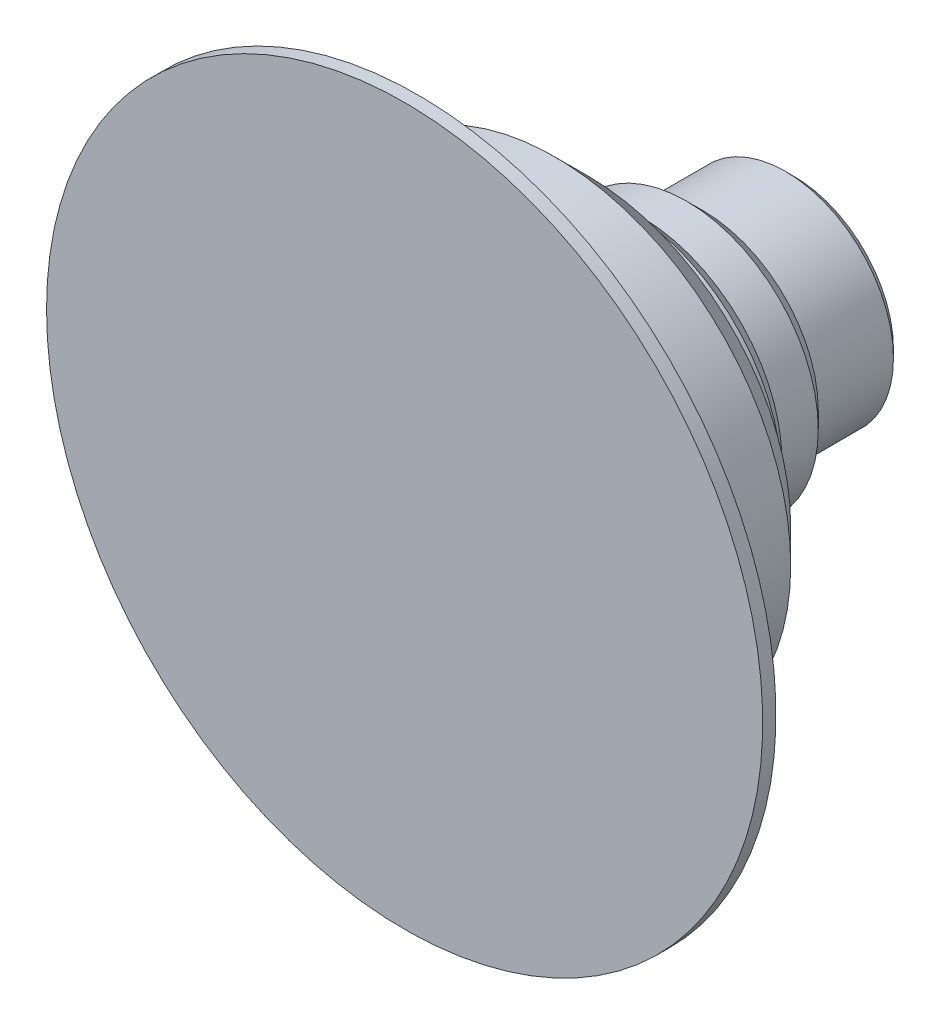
from build123d import *

# Parameters (mm, degrees)
CHAMFER1_SIZE      = 2.54
CHAMFER2_SIZE      = 1.27
CHAMFER3_SIZE      = 0.635
CUT_EXTRUDE1_DEPTH = 0.254


with BuildPart() as part:
    # Sketch1 → Revolve1 (revolve)
    with BuildSketch(Plane(origin=(0, 0, 0), x_dir=(1, 0, 0), z_dir=(0, 1, 0)), mode=Mode.PRIVATE) as revolve1_sk:
        Polygon((0, 0), (27.0891, 0), (27.0891, 1), (19.4691, 1), (19.4691, 3.173357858), (17.8435, 3.173357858), (17.8435, 13.9032), (11.9761, 13.9032), (11.9761, 17.8402), (9.9695, 17.8402), (9.9695, 22.59), (8.1661, 22.59), (8.1661, 29.448), (3.429, 29.448), (3.429, 28.94), (0, 28.94), (0, 13.9032), align=None)
    revolve(revolve1_sk.sketch.rotate(Axis((0, 0, -13.9032), (0, 0, 1)), 180), axis=Axis((0, 0, -13.9032), (0, 0, 1)))

    # Chamfer1
    chamfer1_edges = [part.edges().sort_by_distance(p)[0] for p in [
        (17.8435, 0, -13.9032),
    ]]
    chamfer(chamfer1_edges, length=CHAMFER1_SIZE)

    # Chamfer2
    chamfer2_edges = [part.edges().sort_by_distance(p)[0] for p in [
        (9.9695, 0, -22.59),
        (11.9761, 0, -17.8402),
    ]]
    chamfer(chamfer2_edges, length=CHAMFER2_SIZE)

    # Chamfer3
    chamfer3_edges = [part.edges().sort_by_distance(p)[0] for p in [
        (8.1661, 0, -29.448),
    ]]
    chamfer(chamfer3_edges, length=CHAMFER3_SIZE)

    # Sketch2 → Cut-Extrude1 (cut)
    with BuildSketch(Plane(origin=(0, 0, -1), x_dir=(-1, 0, 0), z_dir=(0, 0, -1))):
        with BuildLine():
            Line((-6.428783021, -21.571208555), (-6.742885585, -21.571208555))
            add(Edge.make_bspline(
                [(-6.742885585, -21.571208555), (-6.734376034, -21.535976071), (-6.717740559, -21.467099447), (-6.683042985, -21.368692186), (-6.64524373, -21.275568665), (-6.599854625, -21.189472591), (-6.550345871, -21.108673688), (-6.49362315, -21.035004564), (-6.432303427, -20.966591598), (-6.364478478, -20.905878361), (-6.293349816, -20.850900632), (-6.217915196, -20.804025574), (-6.139692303, -20.763701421), (-6.05813917, -20.73048119), (-5.973012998, -20.705455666), (-5.885083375, -20.68729886), (-5.794119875, -20.675507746), (-5.732372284, -20.674356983), (-5.701018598, -20.673772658)],
                knots=[0, 0, 0, 0, 1.162005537, 2.271625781, 3.343758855, 4.383309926, 5.390229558, 6.379919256, 7.361854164, 8.333198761, 9.295911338, 10.242430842, 11.177959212, 12.116337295, 13.062827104, 14.020064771, 14.994644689, 16, 16, 16, 16], degree=3))
            add(Edge.make_bspline(
                [(-5.701018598, -20.673772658), (-5.655335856, -20.675151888), (-5.564966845, -20.677880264), (-5.432203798, -20.7027947), (-5.304176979, -20.742219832), (-5.182287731, -20.79669356), (-5.069069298, -20.863880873), (-4.968333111, -20.94384561), (-4.881444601, -21.035044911), (-4.808550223, -21.135777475), (-4.751475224, -21.243432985), (-4.70938885, -21.354233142), (-4.683767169, -21.467915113), (-4.680446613, -21.544672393), (-4.678783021, -21.583127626)],
                knots=[0, 0, 0, 0, 1.083050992, 2.142477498, 3.193116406, 4.255571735, 5.30263384, 6.308962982, 7.297363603, 8.282367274, 9.249857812, 10.179914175, 11.08814088, 12, 12, 12, 12], degree=3))
            add(Edge.make_bspline(
                [(-4.678783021, -21.583127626), (-4.679946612, -21.620134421), (-4.682223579, -21.692550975), (-4.701557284, -21.798272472), (-4.734093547, -21.897914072), (-4.77916331, -21.991895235), (-4.83750486, -22.079620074), (-4.908177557, -22.161285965), (-4.991680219, -22.237255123), (-5.054959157, -22.280774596), (-5.087537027, -22.303179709)],
                knots=[0, 0, 0, 0, 1.024540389, 2.004866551, 2.965041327, 3.920577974, 4.882998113, 5.874504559, 6.905732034, 8, 8, 8, 8], degree=3))
            add(Edge.make_bspline(
                [(-5.087537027, -22.303179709), (-5.050305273, -22.321157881), (-4.976538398, -22.356777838), (-4.875987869, -22.426633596), (-4.784709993, -22.507289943), (-4.733806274, -22.570232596), (-4.708230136, -22.601857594)],
                knots=[0, 0, 0, 0, 1.015518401, 2.012035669, 3.001164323, 4, 4, 4, 4], degree=3))
            add(Edge.make_bspline(
                [(-4.708230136, -22.601857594), (-4.691388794, -22.624915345), (-4.657981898, -22.670653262), (-4.616746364, -22.744189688), (-4.57933725, -22.818541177), (-4.55018703, -22.895700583), (-4.527613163, -22.974773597), (-4.511477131, -23.055895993), (-4.50145299, -23.139134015), (-4.500017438, -23.195446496), (-4.499295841, -23.223752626)],
                knots=[0, 0, 0, 0, 1.025084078, 2.033381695, 3.024893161, 4.013698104, 4.991890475, 5.976764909, 6.982997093, 8, 8, 8, 8], degree=3))
            add(Edge.make_bspline(
                [(-4.499295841, -23.223752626), (-4.501090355, -23.272762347), (-4.504670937, -23.370551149), (-4.536675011, -23.515025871), (-4.586288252, -23.656251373), (-4.656745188, -23.791326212), (-4.742612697, -23.917706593), (-4.844770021, -24.030782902), (-4.962056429, -24.127981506), (-5.092862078, -24.209191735), (-5.234579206, -24.274109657), (-5.386154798, -24.3191671), (-5.545404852, -24.348513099), (-5.65461215, -24.351659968), (-5.710133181, -24.353259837)],
                knots=[0, 0, 0, 0, 0.955779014, 1.907060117, 2.875433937, 3.871313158, 4.872415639, 5.851225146, 6.836215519, 7.83643374, 8.849228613, 9.86973379, 10.916971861, 12, 12, 12, 12], degree=3))
            add(Edge.make_bspline(
                [(-5.710133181, -24.353259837), (-5.747552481, -24.352391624), (-5.821181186, -24.35068327), (-5.929424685, -24.339004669), (-6.032746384, -24.317674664), (-6.131285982, -24.288971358), (-6.225131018, -24.252579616), (-6.313995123, -24.207260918), (-6.398425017, -24.153949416), (-6.477623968, -24.092015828), (-6.551582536, -24.022734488), (-6.61833526, -23.944875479), (-6.678995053, -23.859878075), (-6.731937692, -23.766755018), (-6.779574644, -23.666709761), (-6.818755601, -23.558461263), (-6.85324117, -23.442977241), (-6.869274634, -23.362499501), (-6.877500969, -23.321208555)],
                knots=[0, 0, 0, 0, 1.048658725, 2.063410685, 3.046034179, 4.001477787, 4.936774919, 5.862367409, 6.792675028, 7.730719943, 8.675894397, 9.627829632, 10.600096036, 11.597688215, 12.626045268, 13.701542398, 14.82072376, 16, 16, 16, 16], degree=3))
            Line((-6.877500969, -23.321208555), (-6.563398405, -23.321208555))
            add(Edge.make_bspline(
                [(-6.563398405, -23.321208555), (-6.555215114, -23.348157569), (-6.539297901, -23.40057574), (-6.512203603, -23.476016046), (-6.481335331, -23.545174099), (-6.448220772, -23.608557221), (-6.413442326, -23.666789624), (-6.374527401, -23.718331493), (-6.334358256, -23.765446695), (-6.304078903, -23.791991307), (-6.289259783, -23.804982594)],
                knots=[0, 0, 0, 0, 1.198163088, 2.33053128, 3.407730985, 4.417276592, 5.372219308, 6.28897303, 7.162600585, 8, 8, 8, 8], degree=3))
            add(Edge.make_bspline(
                [(-6.289259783, -23.804982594), (-6.269663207, -23.820090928), (-6.230530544, -23.85026096), (-6.166762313, -23.888762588), (-6.099697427, -23.922123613), (-6.027882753, -23.947607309), (-5.952867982, -23.96918497), (-5.873440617, -23.983305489), (-5.7903014, -23.99299366), (-5.733533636, -23.993848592), (-5.704524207, -23.994285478)],
                knots=[0, 0, 0, 0, 0.946170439, 1.889420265, 2.845303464, 3.807233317, 4.801018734, 5.828864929, 6.890507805, 8, 8, 8, 8], degree=3))
            add(Edge.make_bspline(
                [(-5.704524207, -23.994285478), (-5.671770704, -23.993669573), (-5.607724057, -23.992465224), (-5.514269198, -23.981389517), (-5.42536175, -23.965259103), (-5.341988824, -23.940346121), (-5.263058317, -23.909565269), (-5.189676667, -23.870916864), (-5.120880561, -23.825572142), (-5.057551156, -23.774032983), (-5.000605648, -23.717611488), (-4.950466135, -23.658598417), (-4.907841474, -23.597242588), (-4.873457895, -23.533204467), (-4.846307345, -23.466749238), (-4.827824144, -23.397690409), (-4.814972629, -23.326593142), (-4.813926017, -23.278264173), (-4.813398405, -23.253900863)],
                knots=[0, 0, 0, 0, 1.217147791, 2.380027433, 3.494444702, 4.572153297, 5.609568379, 6.639424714, 7.649109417, 8.668170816, 9.669597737, 10.625200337, 11.543417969, 12.441394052, 13.322311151, 14.205496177, 15.095365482, 16, 16, 16, 16], degree=3))
            add(Edge.make_bspline(
                [(-4.813398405, -23.253900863), (-4.814928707, -23.221289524), (-4.817981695, -23.156229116), (-4.841290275, -23.060511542), (-4.879629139, -22.968288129), (-4.93330165, -22.881132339), (-4.998637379, -22.800356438), (-5.075002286, -22.728284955), (-5.163030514, -22.668814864), (-5.244050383, -22.627726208), (-5.31581554, -22.599689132), (-5.377230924, -22.581014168), (-5.445987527, -22.565200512), (-5.521253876, -22.550488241), (-5.603597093, -22.537966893), (-5.692927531, -22.527525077), (-5.789263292, -22.519170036), (-5.855954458, -22.515438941), (-5.890321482, -22.513516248)],
                knots=[0, 0, 0, 0, 1.07054697, 2.135767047, 3.216561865, 4.33974944, 5.486079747, 6.621378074, 7.775625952, 8.963672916, 9.598146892, 10.304877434, 11.070270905, 11.915000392, 12.823868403, 13.805723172, 14.86925407, 16, 16, 16, 16], degree=3))
            Line((-5.890321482, -22.513516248), (-5.890321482, -22.154541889))
            add(Edge.make_bspline(
                [(-5.890321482, -22.154541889), (-5.847020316, -22.153807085), (-5.76220397, -22.152367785), (-5.638309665, -22.134959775), (-5.519836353, -22.110879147), (-5.409409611, -22.073993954), (-5.308760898, -22.031153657), (-5.221441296, -21.981301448), (-5.148674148, -21.925886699), (-5.090813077, -21.864054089), (-5.047283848, -21.797739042), (-5.015457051, -21.728622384), (-4.996656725, -21.656098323), (-4.994147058, -21.606603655), (-4.992885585, -21.581725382)],
                knots=[0, 0, 0, 0, 1.321986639, 2.589447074, 3.816329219, 5.01088745, 6.139805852, 7.153945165, 8.075214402, 8.924034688, 9.728124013, 10.488707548, 11.240355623, 12, 12, 12, 12], degree=3))
            add(Edge.make_bspline(
                [(-4.992885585, -21.581725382), (-4.993299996, -21.563447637), (-4.994124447, -21.52708493), (-5.004521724, -21.473959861), (-5.020145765, -21.422458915), (-5.041625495, -21.372801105), (-5.070375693, -21.325330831), (-5.10478168, -21.279643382), (-5.14574978, -21.235999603), (-5.192695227, -21.195319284), (-5.243107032, -21.156550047), (-5.298356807, -21.12363641), (-5.356778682, -21.095491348), (-5.418437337, -21.072281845), (-5.483532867, -21.054822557), (-5.551759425, -21.042286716), (-5.623247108, -21.034449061), (-5.67201884, -21.033320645), (-5.696811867, -21.032747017)],
                knots=[0, 0, 0, 0, 0.884392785, 1.759457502, 2.611959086, 3.489218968, 4.37281399, 5.2945488, 6.255912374, 7.266815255, 8.301784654, 9.332968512, 10.37626691, 11.440494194, 12.520033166, 13.637162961, 14.798855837, 16, 16, 16, 16], degree=3))
            add(Edge.make_bspline(
                [(-5.696811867, -21.032747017), (-5.736663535, -21.034138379), (-5.814503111, -21.036856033), (-5.926718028, -21.060659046), (-6.031037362, -21.098637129), (-6.110776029, -21.143970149), (-6.169658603, -21.188720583), (-6.211735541, -21.227802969), (-6.253056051, -21.271235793), (-6.290901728, -21.321694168), (-6.329175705, -21.375760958), (-6.364020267, -21.43618464), (-6.397879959, -21.501389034), (-6.418282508, -21.547484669), (-6.428783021, -21.571208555)],
                knots=[0, 0, 0, 0, 1.472543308, 2.876219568, 4.221790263, 5.565193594, 6.249813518, 6.953379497, 7.687249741, 8.463570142, 9.283606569, 10.136032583, 11.040678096, 12, 12, 12, 12], degree=3))
        make_face()
        with BuildLine():
            Line((-1.986475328, -20.763516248), (-1.986475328, -21.122490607))
            Line((-1.986475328, -21.122490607), (-3.176980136, -21.122490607))
            Line((-3.176980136, -21.122490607), (-3.365581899, -22.043063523))
            add(Edge.make_bspline(
                [(-3.365581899, -22.043063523), (-3.328526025, -22.032833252), (-3.256736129, -22.013013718), (-3.150776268, -21.991007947), (-3.050184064, -21.977742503), (-2.984908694, -21.975931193), (-2.953322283, -21.975054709)],
                knots=[0, 0, 0, 0, 1.100273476, 2.13160584, 3.095893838, 4, 4, 4, 4], degree=3))
            add(Edge.make_bspline(
                [(-2.953322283, -21.975054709), (-2.914238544, -21.975900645), (-2.837390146, -21.977563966), (-2.724951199, -21.993535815), (-2.617618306, -22.01867573), (-2.515615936, -22.053796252), (-2.418755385, -22.098705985), (-2.327927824, -22.154805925), (-2.241769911, -22.220339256), (-2.161827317, -22.295684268), (-2.089303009, -22.378605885), (-2.025537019, -22.467763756), (-1.971374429, -22.562291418), (-1.927813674, -22.663092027), (-1.89302934, -22.76905118), (-1.869877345, -22.881283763), (-1.854460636, -22.998731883), (-1.85273825, -23.079036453), (-1.851859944, -23.1199866)],
                knots=[0, 0, 0, 0, 1.052922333, 2.070308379, 3.05430497, 4.020497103, 4.973039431, 5.925935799, 6.892292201, 7.88610001, 8.88166317, 9.857072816, 10.836096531, 11.812156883, 12.81219415, 13.836441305, 14.89672472, 16, 16, 16, 16], degree=3))
            add(Edge.make_bspline(
                [(-1.851859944, -23.1199866), (-1.852525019, -23.148508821), (-1.853846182, -23.205167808), (-1.860564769, -23.289312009), (-1.873500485, -23.371674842), (-1.890868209, -23.452267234), (-1.913410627, -23.530936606), (-1.940699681, -23.607908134), (-1.974095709, -23.682702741), (-2.010727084, -23.756028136), (-2.051973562, -23.826226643), (-2.097752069, -23.891875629), (-2.146117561, -23.953959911), (-2.198158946, -24.011813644), (-2.254359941, -24.065056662), (-2.314039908, -24.114004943), (-2.376722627, -24.159486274), (-2.443377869, -24.199654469), (-2.512520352, -24.236617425), (-2.58514857, -24.266940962), (-2.65960927, -24.29405149), (-2.736974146, -24.315661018), (-2.817067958, -24.332593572), (-2.900022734, -24.344094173), (-2.985403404, -24.352470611), (-3.043278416, -24.352994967), (-3.072512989, -24.353259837)],
                knots=[0, 0, 0, 0, 1.056347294, 2.098418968, 3.122841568, 4.141288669, 5.149314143, 6.15115421, 7.162517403, 8.180376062, 9.185164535, 10.17417709, 11.141909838, 12.097768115, 13.052685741, 14.0056014, 14.954263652, 15.917497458, 16.885230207, 17.854509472, 18.828990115, 19.81800267, 20.826176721, 21.857883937, 22.917946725, 24, 24, 24, 24], degree=3))
            add(Edge.make_bspline(
                [(-3.072512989, -24.353259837), (-3.107387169, -24.352568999), (-3.175998, -24.351209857), (-3.276518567, -24.336991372), (-3.373233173, -24.316627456), (-3.465363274, -24.285991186), (-3.553734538, -24.247603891), (-3.637157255, -24.19908772), (-3.717763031, -24.144108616), (-3.792275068, -24.079228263), (-3.861431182, -24.008312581), (-3.923337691, -23.93135494), (-3.978471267, -23.849625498), (-4.025949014, -23.762727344), (-4.066447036, -23.670888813), (-4.098262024, -23.573765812), (-4.123940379, -23.471865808), (-4.134803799, -23.401712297), (-4.140321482, -23.36608035)],
                knots=[0, 0, 0, 0, 1.0467383, 2.05933395, 3.04377827, 4.011590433, 4.970194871, 5.932262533, 6.905835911, 7.896367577, 8.894135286, 9.877477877, 10.858688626, 11.851381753, 12.8477658, 13.868841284, 14.917554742, 16, 16, 16, 16], degree=3))
            Line((-4.140321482, -23.36608035), (-3.826218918, -23.36608035))
            add(Edge.make_bspline(
                [(-3.826218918, -23.36608035), (-3.818490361, -23.399456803), (-3.803635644, -23.463608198), (-3.771029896, -23.553739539), (-3.73116402, -23.634058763), (-3.683759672, -23.705628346), (-3.627209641, -23.768037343), (-3.562680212, -23.823654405), (-3.490332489, -23.873829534), (-3.409939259, -23.915652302), (-3.32512618, -23.951321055), (-3.23635897, -23.97507275), (-3.146054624, -23.991773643), (-3.084976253, -23.993445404), (-3.054283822, -23.994285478)],
                knots=[0, 0, 0, 0, 1.136247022, 2.183929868, 3.172523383, 4.106158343, 5.02341133, 5.958108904, 6.928429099, 7.938127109, 8.96079061, 9.975095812, 10.982467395, 12, 12, 12, 12], degree=3))
            add(Edge.make_bspline(
                [(-3.054283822, -23.994285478), (-3.024325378, -23.993464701), (-2.965336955, -23.991848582), (-2.878525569, -23.97940957), (-2.794712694, -23.960251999), (-2.714725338, -23.931582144), (-2.637163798, -23.896737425), (-2.563990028, -23.85202235), (-2.493087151, -23.800562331), (-2.426659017, -23.741605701), (-2.365819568, -23.676636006), (-2.312063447, -23.607158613), (-2.267286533, -23.533041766), (-2.229552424, -23.455568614), (-2.200899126, -23.373890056), (-2.180458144, -23.288388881), (-2.168455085, -23.198853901), (-2.166803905, -23.137784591), (-2.165962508, -23.106665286)],
                knots=[0, 0, 0, 0, 1.027316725, 2.022795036, 3.002884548, 3.971462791, 4.93288096, 5.914575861, 6.907176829, 7.935150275, 8.956128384, 9.956726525, 10.942570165, 11.921478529, 12.907843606, 13.90538589, 14.932640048, 16, 16, 16, 16], degree=3))
            add(Edge.make_bspline(
                [(-2.165962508, -23.106665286), (-2.166620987, -23.078589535), (-2.167909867, -23.023635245), (-2.178440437, -22.943236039), (-2.19675741, -22.867162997), (-2.22218129, -22.795048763), (-2.254460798, -22.72682532), (-2.29390711, -22.66242226), (-2.341260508, -22.602688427), (-2.395352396, -22.547595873), (-2.454610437, -22.496750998), (-2.52005418, -22.453406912), (-2.590314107, -22.416942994), (-2.664543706, -22.385474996), (-2.744508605, -22.362874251), (-2.828625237, -22.345906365), (-2.917801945, -22.336091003), (-2.978772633, -22.334729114), (-3.010113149, -22.334029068)],
                knots=[0, 0, 0, 0, 1.045622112, 2.046656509, 3.013763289, 3.955457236, 4.890082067, 5.820317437, 6.762574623, 7.722996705, 8.69280354, 9.665887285, 10.63943826, 11.638615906, 12.663482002, 13.728887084, 14.832589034, 16, 16, 16, 16], degree=3))
            add(Edge.make_bspline(
                [(-3.010113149, -22.334029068), (-3.037242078, -22.334609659), (-3.093256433, -22.335808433), (-3.17917926, -22.34463493), (-3.269470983, -22.358874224), (-3.363785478, -22.378460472), (-3.462405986, -22.404091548), (-3.565124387, -22.434806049), (-3.672156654, -22.471528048), (-3.744274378, -22.499260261), (-3.781347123, -22.513516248)],
                knots=[0, 0, 0, 0, 0.817624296, 1.688186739, 2.600797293, 3.572016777, 4.590301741, 5.671205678, 6.80286297, 8, 8, 8, 8], degree=3))
            Line((-3.781347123, -22.513516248), (-3.422372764, -20.763516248))
            Line((-3.422372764, -20.763516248), (-1.986475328, -20.763516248))
        make_face()
        with BuildLine():
            Line((-1.26852661, -21.70582394), (-0.954424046, -21.70582394))
            Line((-0.954424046, -21.70582394), (-0.954424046, -22.150335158))
            add(Edge.make_bspline(
                [(-0.954424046, -22.150335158), (-0.926140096, -22.111447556), (-0.871945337, -22.036935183), (-0.783079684, -21.938744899), (-0.694303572, -21.855416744), (-0.63037019, -21.811673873), (-0.599656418, -21.790659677)],
                knots=[0, 0, 0, 0, 1.134379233, 2.173579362, 3.122582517, 4, 4, 4, 4], degree=3))
            add(Edge.make_bspline(
                [(-0.599656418, -21.790659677), (-0.557791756, -21.770654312), (-0.474793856, -21.730993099), (-0.343374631, -21.69075954), (-0.208899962, -21.666034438), (-0.118091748, -21.662653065), (-0.072412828, -21.660952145)],
                knots=[0, 0, 0, 0, 1.014936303, 2.012140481, 3.000054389, 4, 4, 4, 4], degree=3))
            add(Edge.make_bspline(
                [(-0.072412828, -21.660952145), (-0.041519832, -21.661997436), (0.019615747, -21.66406601), (0.110199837, -21.677526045), (0.198058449, -21.700792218), (0.282672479, -21.733199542), (0.362393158, -21.772446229), (0.435482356, -21.818495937), (0.501106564, -21.870193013), (0.559232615, -21.929871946), (0.61150164, -21.999208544), (0.659580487, -22.080072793), (0.704005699, -22.174280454), (0.728627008, -22.242646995), (0.741589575, -22.278640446)],
                knots=[0, 0, 0, 0, 1.009824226, 1.998387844, 2.986035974, 3.974953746, 4.955485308, 5.885931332, 6.793869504, 7.679848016, 8.601185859, 9.625726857, 10.749998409, 12, 12, 12, 12], degree=3))
            add(Edge.make_bspline(
                [(0.741589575, -22.278640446), (0.755300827, -22.253916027), (0.782282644, -22.205261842), (0.827588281, -22.13640358), (0.875056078, -22.071996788), (0.925090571, -22.011990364), (0.977515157, -21.956680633), (1.032576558, -21.905884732), (1.089961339, -21.859384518), (1.169753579, -21.805061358), (1.273566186, -21.747360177), (1.404454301, -21.697331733), (1.540604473, -21.666415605), (1.633022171, -21.662785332), (1.679690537, -21.660952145)],
                knots=[0, 0, 0, 0, 0.86119277, 1.694706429, 2.50939023, 3.298075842, 4.073795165, 4.829715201, 5.57930267, 6.321991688, 7.768977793, 9.186738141, 10.579381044, 12, 12, 12, 12], degree=3))
            add(Edge.make_bspline(
                [(1.679690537, -21.660952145), (1.722572, -21.662569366), (1.806495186, -21.665734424), (1.928672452, -21.690587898), (2.042614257, -21.733265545), (2.148091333, -21.791499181), (2.243251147, -21.864678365), (2.325967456, -21.951747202), (2.395737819, -22.052089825), (2.441316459, -22.146481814), (2.472231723, -22.229817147), (2.491292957, -22.300823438), (2.508132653, -22.378974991), (2.522113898, -22.464365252), (2.53233245, -22.557295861), (2.539903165, -22.657614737), (2.545027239, -22.765399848), (2.545389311, -22.839765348), (2.545575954, -22.878099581)],
                knots=[0, 0, 0, 0, 1.209669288, 2.367440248, 3.500751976, 4.631527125, 5.755587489, 6.87532382, 8.007944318, 9.190864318, 9.82315674, 10.514484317, 11.263564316, 12.079023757, 12.955305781, 13.901327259, 14.918167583, 16, 16, 16, 16], degree=3))
            Line((2.545575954, -22.878099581), (2.545575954, -24.263516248))
            Line((2.545575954, -24.263516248), (2.23147339, -24.263516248))
            Line((2.23147339, -24.263516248), (2.23147339, -22.876697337))
            add(Edge.make_bspline(
                [(2.23147339, -22.876697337), (2.231395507, -22.843976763), (2.231245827, -22.781092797), (2.228552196, -22.690840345), (2.223476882, -22.608571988), (2.217542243, -22.5343999), (2.209298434, -22.468151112), (2.198652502, -22.409958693), (2.187374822, -22.359364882), (2.168638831, -22.303278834), (2.138690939, -22.241408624), (2.093073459, -22.174685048), (2.035603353, -22.116604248), (1.969243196, -22.066185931), (1.893694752, -22.02519229), (1.810430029, -21.99591628), (1.719965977, -21.977793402), (1.657343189, -21.975987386), (1.625003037, -21.975054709)],
                knots=[0, 0, 0, 0, 1.253487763, 2.409012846, 3.458416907, 4.410876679, 5.259312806, 6.014470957, 6.676830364, 7.243083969, 8.276244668, 9.299465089, 10.325150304, 11.392391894, 12.482080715, 13.603491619, 14.762376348, 16, 16, 16, 16], degree=3))
            add(Edge.make_bspline(
                [(1.625003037, -21.975054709), (1.585333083, -21.976470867), (1.506930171, -21.979269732), (1.392484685, -22.007843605), (1.282513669, -22.050923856), (1.180298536, -22.113356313), (1.086270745, -22.188164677), (1.005371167, -22.277114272), (0.938538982, -22.377744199), (0.893285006, -22.470890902), (0.864695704, -22.554560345), (0.845818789, -22.627657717), (0.831135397, -22.710739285), (0.817364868, -22.803246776), (0.80837714, -22.905816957), (0.800208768, -23.017975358), (0.796387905, -23.140059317), (0.795853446, -23.224686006), (0.795575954, -23.268624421)],
                knots=[0, 0, 0, 0, 1.090531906, 2.155305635, 3.229839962, 4.33261226, 5.44038871, 6.529323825, 7.629011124, 8.757537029, 9.370236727, 10.061839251, 10.834451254, 11.692844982, 12.636905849, 13.66920014, 14.789842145, 16, 16, 16, 16], degree=3))
            Line((0.795575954, -23.268624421), (0.795575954, -24.263516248))
            Line((0.795575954, -24.263516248), (0.48147339, -24.263516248))
            Line((0.48147339, -24.263516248), (0.48147339, -22.962935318))
            add(Edge.make_bspline(
                [(0.48147339, -22.962935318), (0.481393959, -22.926241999), (0.481241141, -22.855647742), (0.478564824, -22.754414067), (0.473478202, -22.662332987), (0.467597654, -22.579511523), (0.459137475, -22.506100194), (0.449527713, -22.441705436), (0.438179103, -22.386488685), (0.419389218, -22.3259253), (0.39067475, -22.259204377), (0.344486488, -22.188063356), (0.286878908, -22.125795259), (0.219308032, -22.07263651), (0.14330235, -22.028695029), (0.059318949, -21.997035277), (-0.031885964, -21.978610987), (-0.09476367, -21.976262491), (-0.127100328, -21.975054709)],
                knots=[0, 0, 0, 0, 1.320475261, 2.540461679, 3.643808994, 4.639130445, 5.527981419, 6.302341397, 6.981980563, 7.553956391, 8.582137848, 9.585246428, 10.591171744, 11.620968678, 12.668337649, 13.738356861, 14.836885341, 16, 16, 16, 16], degree=3))
            add(Edge.make_bspline(
                [(-0.127100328, -21.975054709), (-0.16511654, -21.976585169), (-0.240881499, -21.979635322), (-0.352183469, -22.007089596), (-0.459669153, -22.05009367), (-0.561623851, -22.109753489), (-0.655298, -22.183652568), (-0.737306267, -22.270567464), (-0.806248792, -22.369416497), (-0.851980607, -22.461581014), (-0.881479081, -22.543154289), (-0.901074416, -22.612505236), (-0.917914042, -22.689505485), (-0.930428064, -22.774392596), (-0.942508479, -22.86661369), (-0.948338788, -22.96662818), (-0.95401035, -23.074350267), (-0.954282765, -23.148722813), (-0.954424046, -23.187294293)],
                knots=[0, 0, 0, 0, 1.098833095, 2.189935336, 3.297829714, 4.440610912, 5.596351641, 6.740013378, 7.886572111, 9.072425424, 9.705826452, 10.395263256, 11.156850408, 11.985370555, 12.878090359, 13.847760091, 14.883794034, 16, 16, 16, 16], degree=3))
            Line((-0.954424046, -23.187294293), (-0.954424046, -24.263516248))
            Line((-0.954424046, -24.263516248), (-1.26852661, -24.263516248))
            Line((-1.26852661, -24.263516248), (-1.26852661, -21.70582394))
        make_face()
        with BuildLine():
            Line((3.263524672, -21.70582394), (3.577627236, -21.70582394))
            Line((3.577627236, -21.70582394), (3.577627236, -22.150335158))
            add(Edge.make_bspline(
                [(3.577627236, -22.150335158), (3.605911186, -22.111447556), (3.660105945, -22.036935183), (3.748971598, -21.938744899), (3.83774771, -21.855416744), (3.901681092, -21.811673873), (3.932394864, -21.790659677)],
                knots=[0, 0, 0, 0, 1.134379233, 2.173579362, 3.122582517, 4, 4, 4, 4], degree=3))
            add(Edge.make_bspline(
                [(3.932394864, -21.790659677), (3.974259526, -21.770654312), (4.057257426, -21.730993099), (4.188676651, -21.69075954), (4.32315132, -21.666034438), (4.413959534, -21.662653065), (4.459638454, -21.660952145)],
                knots=[0, 0, 0, 0, 1.014936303, 2.012140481, 3.000054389, 4, 4, 4, 4], degree=3))
            add(Edge.make_bspline(
                [(4.459638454, -21.660952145), (4.49053145, -21.661997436), (4.551667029, -21.66406601), (4.642251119, -21.677526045), (4.730109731, -21.700792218), (4.814723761, -21.733199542), (4.89444444, -21.772446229), (4.967533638, -21.818495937), (5.033157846, -21.870193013), (5.091283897, -21.929871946), (5.143552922, -21.999208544), (5.191631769, -22.080072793), (5.236056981, -22.174280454), (5.26067829, -22.242646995), (5.273640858, -22.278640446)],
                knots=[0, 0, 0, 0, 1.009824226, 1.998387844, 2.986035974, 3.974953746, 4.955485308, 5.885931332, 6.793869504, 7.679848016, 8.601185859, 9.625726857, 10.749998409, 12, 12, 12, 12], degree=3))
            add(Edge.make_bspline(
                [(5.273640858, -22.278640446), (5.287352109, -22.253916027), (5.314333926, -22.205261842), (5.359639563, -22.13640358), (5.40710736, -22.071996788), (5.457141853, -22.011990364), (5.509566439, -21.956680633), (5.56462784, -21.905884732), (5.622012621, -21.859384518), (5.701804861, -21.805061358), (5.805617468, -21.747360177), (5.936505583, -21.697331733), (6.072655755, -21.666415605), (6.165073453, -21.662785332), (6.211741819, -21.660952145)],
                knots=[0, 0, 0, 0, 0.86119277, 1.694706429, 2.50939023, 3.298075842, 4.073795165, 4.829715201, 5.57930267, 6.321991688, 7.768977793, 9.186738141, 10.579381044, 12, 12, 12, 12], degree=3))
            add(Edge.make_bspline(
                [(6.211741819, -21.660952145), (6.254623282, -21.662569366), (6.338546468, -21.665734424), (6.460723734, -21.690587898), (6.574665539, -21.733265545), (6.680142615, -21.791499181), (6.775302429, -21.864678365), (6.858018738, -21.951747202), (6.927789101, -22.052089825), (6.973367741, -22.146481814), (7.004283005, -22.229817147), (7.023344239, -22.300823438), (7.040183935, -22.378974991), (7.05416518, -22.464365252), (7.064383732, -22.557295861), (7.071954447, -22.657614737), (7.077078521, -22.765399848), (7.077440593, -22.839765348), (7.077627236, -22.878099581)],
                knots=[0, 0, 0, 0, 1.209669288, 2.367440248, 3.500751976, 4.631527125, 5.755587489, 6.87532382, 8.007944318, 9.190864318, 9.82315674, 10.514484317, 11.263564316, 12.079023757, 12.955305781, 13.901327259, 14.918167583, 16, 16, 16, 16], degree=3))
            Line((7.077627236, -22.878099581), (7.077627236, -24.263516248))
            Line((7.077627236, -24.263516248), (6.763524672, -24.263516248))
            Line((6.763524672, -24.263516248), (6.763524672, -22.876697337))
            add(Edge.make_bspline(
                [(6.763524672, -22.876697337), (6.763446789, -22.843976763), (6.763297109, -22.781092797), (6.760603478, -22.690840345), (6.755528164, -22.608571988), (6.749593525, -22.5343999), (6.741349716, -22.468151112), (6.730703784, -22.409958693), (6.719426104, -22.359364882), (6.700690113, -22.303278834), (6.670742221, -22.241408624), (6.625124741, -22.174685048), (6.567654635, -22.116604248), (6.501294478, -22.066185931), (6.425746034, -22.02519229), (6.342481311, -21.99591628), (6.252017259, -21.977793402), (6.189394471, -21.975987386), (6.157054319, -21.975054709)],
                knots=[0, 0, 0, 0, 1.253487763, 2.409012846, 3.458416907, 4.410876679, 5.259312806, 6.014470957, 6.676830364, 7.243083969, 8.276244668, 9.299465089, 10.325150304, 11.392391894, 12.482080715, 13.603491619, 14.762376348, 16, 16, 16, 16], degree=3))
            add(Edge.make_bspline(
                [(6.157054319, -21.975054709), (6.117384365, -21.976470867), (6.038981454, -21.979269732), (5.924535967, -22.007843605), (5.814564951, -22.050923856), (5.712349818, -22.113356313), (5.618322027, -22.188164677), (5.537422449, -22.277114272), (5.470590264, -22.377744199), (5.425336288, -22.470890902), (5.396746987, -22.554560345), (5.377870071, -22.627657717), (5.363186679, -22.710739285), (5.34941615, -22.803246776), (5.340428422, -22.905816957), (5.33226005, -23.017975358), (5.328439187, -23.140059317), (5.327904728, -23.224686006), (5.327627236, -23.268624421)],
                knots=[0, 0, 0, 0, 1.090531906, 2.155305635, 3.229839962, 4.33261226, 5.44038871, 6.529323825, 7.629011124, 8.757537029, 9.370236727, 10.061839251, 10.834451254, 11.692844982, 12.636905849, 13.66920014, 14.789842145, 16, 16, 16, 16], degree=3))
            Line((5.327627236, -23.268624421), (5.327627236, -24.263516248))
            Line((5.327627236, -24.263516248), (5.013524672, -24.263516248))
            Line((5.013524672, -24.263516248), (5.013524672, -22.962935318))
            add(Edge.make_bspline(
                [(5.013524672, -22.962935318), (5.013445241, -22.926241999), (5.013292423, -22.855647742), (5.010616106, -22.754414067), (5.005529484, -22.662332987), (4.999648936, -22.579511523), (4.991188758, -22.506100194), (4.981578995, -22.441705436), (4.970230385, -22.386488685), (4.9514405, -22.3259253), (4.922726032, -22.259204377), (4.87653777, -22.188063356), (4.81893019, -22.125795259), (4.751359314, -22.07263651), (4.675353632, -22.028695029), (4.591370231, -21.997035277), (4.500165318, -21.978610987), (4.437287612, -21.976262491), (4.404950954, -21.975054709)],
                knots=[0, 0, 0, 0, 1.320475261, 2.540461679, 3.643808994, 4.639130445, 5.527981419, 6.302341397, 6.981980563, 7.553956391, 8.582137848, 9.585246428, 10.591171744, 11.620968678, 12.668337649, 13.738356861, 14.836885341, 16, 16, 16, 16], degree=3))
            add(Edge.make_bspline(
                [(4.404950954, -21.975054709), (4.366934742, -21.976585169), (4.291169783, -21.979635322), (4.179867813, -22.007089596), (4.07238213, -22.05009367), (3.970427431, -22.109753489), (3.876753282, -22.183652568), (3.794745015, -22.270567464), (3.72580249, -22.369416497), (3.680070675, -22.461581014), (3.650572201, -22.543154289), (3.630976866, -22.612505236), (3.61413724, -22.689505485), (3.601623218, -22.774392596), (3.589542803, -22.86661369), (3.583712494, -22.96662818), (3.578040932, -23.074350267), (3.577768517, -23.148722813), (3.577627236, -23.187294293)],
                knots=[0, 0, 0, 0, 1.098833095, 2.189935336, 3.297829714, 4.440610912, 5.596351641, 6.740013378, 7.886572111, 9.072425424, 9.705826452, 10.395263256, 11.156850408, 11.985370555, 12.878090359, 13.847760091, 14.883794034, 16, 16, 16, 16], degree=3))
            Line((3.577627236, -23.187294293), (3.577627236, -24.263516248))
            Line((3.577627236, -24.263516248), (3.263524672, -24.263516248))
            Line((3.263524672, -24.263516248), (3.263524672, -21.70582394))
        make_face()
    extrude(amount=-CUT_EXTRUDE1_DEPTH, mode=Mode.SUBTRACT)


solid = part.part
